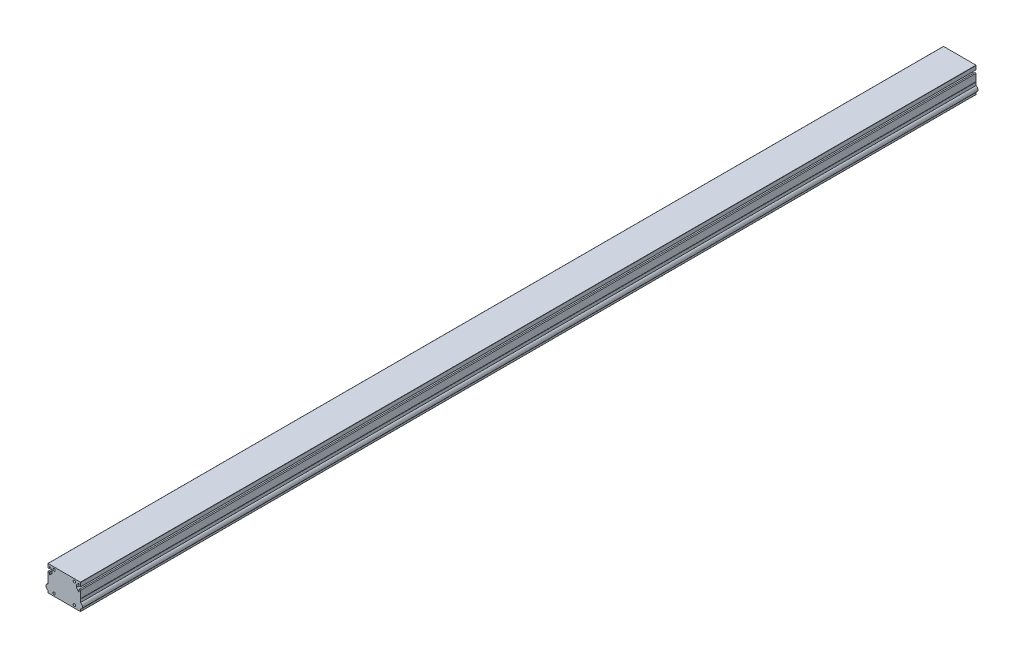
from build123d import *

# Parameters (mm, degrees)
SKIZZE1_W                        = 90
SKIZZE1_H                        = 70
LINEAR_AUSTRAGEN1_DEPTH          = 2460
SCHNITT_LINEAR_AUSTRAGEN4_DEPTH  = 2461.66048044
SCHNITT_LINEAR_AUSTRAGEN3_DEPTH  = 2461.66048044
SCHNITT_LINEAR_AUSTRAGEN5_DEPTH  = 2461.66048044
F_6_7_6_7_DURCHMESSER_BOHRUNG1_D = 6.7
VERRUNDUNG1_R                    = 0.3
VERRUNDUNG2_R                    = 0.5
SKIZZE9_R                        = 8.05
LINEAR_AUSTRAGEN2_DEPTH          = 2460


with BuildPart() as part:
    # Skizze1 → Linear austragen1 (new body)
    with BuildSketch(Plane.XY):
        Rectangle(SKIZZE1_W, SKIZZE1_H)
    extrude(amount=LINEAR_AUSTRAGEN1_DEPTH)

    # Skizze5 → Schnitt-Linear austragen4 (cut, through all)
    with BuildSketch(Plane(origin=(0, 0, 0), x_dir=(-1, 0, 0), z_dir=(0, 0, -1))):
        with BuildLine():
            Line((45, 24.05), (45, 15.95))
            Line((45, 15.95), (41.5, 15.95))
            ThreePointArc((41.5, 15.95), (41.146446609, 15.803553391), (41, 15.45))
            Line((41, 15.45), (41, 10))
            ThreePointArc((41, 10), (40.691341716, 9.538060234), (40.146446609, 9.646446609))
            Line((40.146446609, 9.646446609), (33.2, 16.592893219))
            Line((33.2, 16.592893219), (33.2, 23.407106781))
            Line((33.2, 23.407106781), (40.146446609, 30.353553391))
            ThreePointArc((40.146446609, 30.353553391), (40.691341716, 30.461939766), (41, 30))
            Line((41, 30), (41, 24.55))
            ThreePointArc((41, 24.55), (41.146446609, 24.196446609), (41.5, 24.05))
            Line((41.5, 24.05), (45, 24.05))
        make_face()
    schnitt_linear_austragen4 = extrude(amount=-SCHNITT_LINEAR_AUSTRAGEN4_DEPTH, mode=Mode.SUBTRACT)

    # Skizze4 → Schnitt-Linear austragen3 (cut, through all)
    with BuildSketch(Plane(origin=(0, 0, 0), x_dir=(-1, 0, 0), z_dir=(0, 0, -1))):
        with BuildLine():
            Line((45, -13.529892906), (45, -28.470107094))
            ThreePointArc((45, -28.470107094), (33.95, -21), (45, -13.529892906))
        make_face()
    schnitt_linear_austragen3 = extrude(amount=-SCHNITT_LINEAR_AUSTRAGEN3_DEPTH, mode=Mode.SUBTRACT)

    # Skizze8 → Schnitt-Linear austragen5 (cut, through all)
    with BuildSketch(Plane(origin=(0, 0, 0), x_dir=(-1, 0, 0), z_dir=(0, 0, -1))):
        with BuildLine():
            Line((45, -3.8), (45, -5))
            ThreePointArc((45, -5), (44.4, -4.4), (45, -3.8))
        make_face()
    schnitt_linear_austragen5 = extrude(amount=-SCHNITT_LINEAR_AUSTRAGEN5_DEPTH, mode=Mode.SUBTRACT)

    # 6.7 _6.7_ Durchmesser Bohrung1 (through all)
    with Locations(Plane(origin=(0, 0, 0), x_dir=(-1, 0, 0), z_dir=(0, 0, -1))):
        with Locations((28, -28), (28, 28)):
            f_6_7_6_7_durchmesser_bohrung1 = Hole(F_6_7_6_7_DURCHMESSER_BOHRUNG1_D / 2)

    # Spiegeln1: Schnitt-Linear austragen4, Schnitt-Linear austragen3, Schnitt-Linear austragen5, 6.7 _6.7_ Durchmesser Bohrung1 across plane
    add(schnitt_linear_austragen4.mirror(Plane(origin=(0, 0, 0), x_dir=(0, 0, 1), z_dir=(1, 0, 0))), mode=Mode.SUBTRACT)
    add(schnitt_linear_austragen3.mirror(Plane(origin=(0, 0, 0), x_dir=(0, 0, 1), z_dir=(1, 0, 0))), mode=Mode.SUBTRACT)
    add(schnitt_linear_austragen5.mirror(Plane(origin=(0, 0, 0), x_dir=(0, 0, 1), z_dir=(1, 0, 0))), mode=Mode.SUBTRACT)
    add(f_6_7_6_7_durchmesser_bohrung1.mirror(Plane(origin=(0, 0, 0), x_dir=(0, 0, 1), z_dir=(1, 0, 0))), mode=Mode.SUBTRACT)

    # Verrundung1
    verrundung1_edges = [part.edges().sort_by_distance(p)[0] for p in [
        (45, -13.529892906, 1230),
        (45, -28.470107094, 1230),
        (-45, -28.470107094, 1230),
        (-45, -13.529892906, 1230),
    ]]
    fillet(verrundung1_edges, radius=VERRUNDUNG1_R)

    # Verrundung2
    verrundung2_edges = [part.edges().sort_by_distance(p)[0] for p in [
        (-45, 35, 1230),
        (45, 35, 1230),
        (45, -35, 1230),
        (-45, -35, 1230),
    ]]
    fillet(verrundung2_edges, radius=VERRUNDUNG2_R)

    # Skizze9 → Linear austragen2 (add)
    with BuildSketch(Plane(origin=(0, 0, 0), x_dir=(-1, 0, 0), z_dir=(0, 0, -1))):
        with Locations((-42, -21)):
            Circle(SKIZZE9_R)
        with Locations((42, -21)):
            Circle(SKIZZE9_R)
    extrude(amount=-LINEAR_AUSTRAGEN2_DEPTH)


solid = part.part
